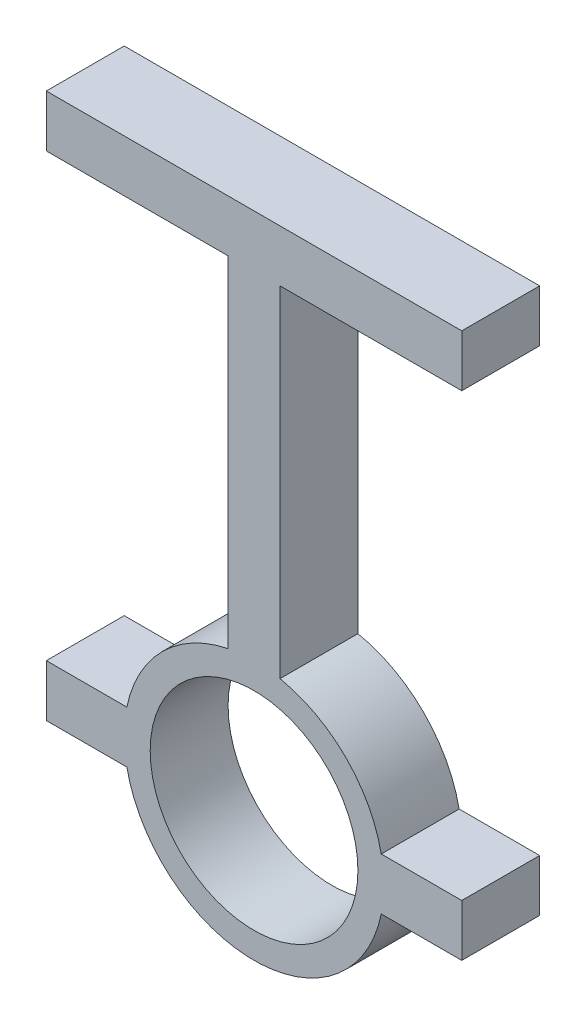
from build123d import *

# Parameters (mm, degrees)
ESQUISSE1_R        = 20
BOSS_EXTRU_1_DEPTH = 15


with BuildPart() as part:
    # Esquisse1 → Boss.-Extru.1 (new body)
    with BuildSketch(Plane.XY):
        with BuildLine():
            Line((5, 24.494897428), (5, 90))
            Line((5, 90), (40, 90))
            Line((40, 90), (40, 100))
            Line((40, 100), (-40, 100))
            Line((-40, 100), (-40, 90))
            Line((-40, 90), (-5, 90))
            Line((-5, 90), (-5, 24.494897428))
            ThreePointArc((-5, 24.494897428), (-17.67766953, 17.67766953), (-24.494897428, 5))
            Line((-24.494897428, 5), (-40, 5))
            Line((-40, 5), (-40, -5))
            Line((-40, -5), (-24.494897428, -5))
            ThreePointArc((-24.494897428, -5), (0, -25), (24.494897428, -5))
            Line((24.494897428, -5), (40, -5))
            Line((40, -5), (40, 5))
            Line((40, 5), (24.494897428, 5))
            ThreePointArc((24.494897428, 5), (17.67766953, 17.67766953), (5, 24.494897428))
        make_face()
        Circle(ESQUISSE1_R, mode=Mode.SUBTRACT)
    extrude(amount=BOSS_EXTRU_1_DEPTH)


solid = part.part
